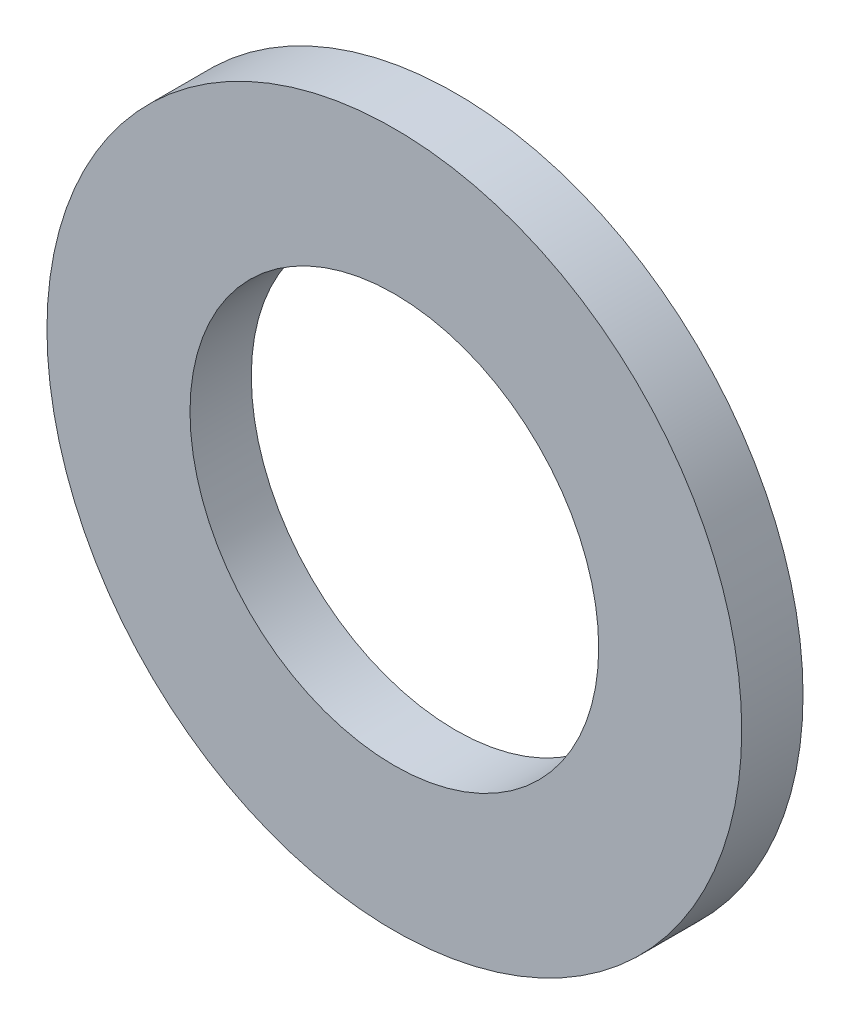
from build123d import *

# Parameters (mm, degrees)
ESQUISSE1_R      = 8.5
ESQUISSE1_R_2    = 5
EXTRUSION1_DEPTH = 1.5


with BuildPart() as part:
    # Esquisse1 → Extrusion1 (new body)
    with BuildSketch(Plane.XY):
        Circle(ESQUISSE1_R)
        Circle(ESQUISSE1_R_2, mode=Mode.SUBTRACT)
    extrude(amount=EXTRUSION1_DEPTH)


solid = part.part
